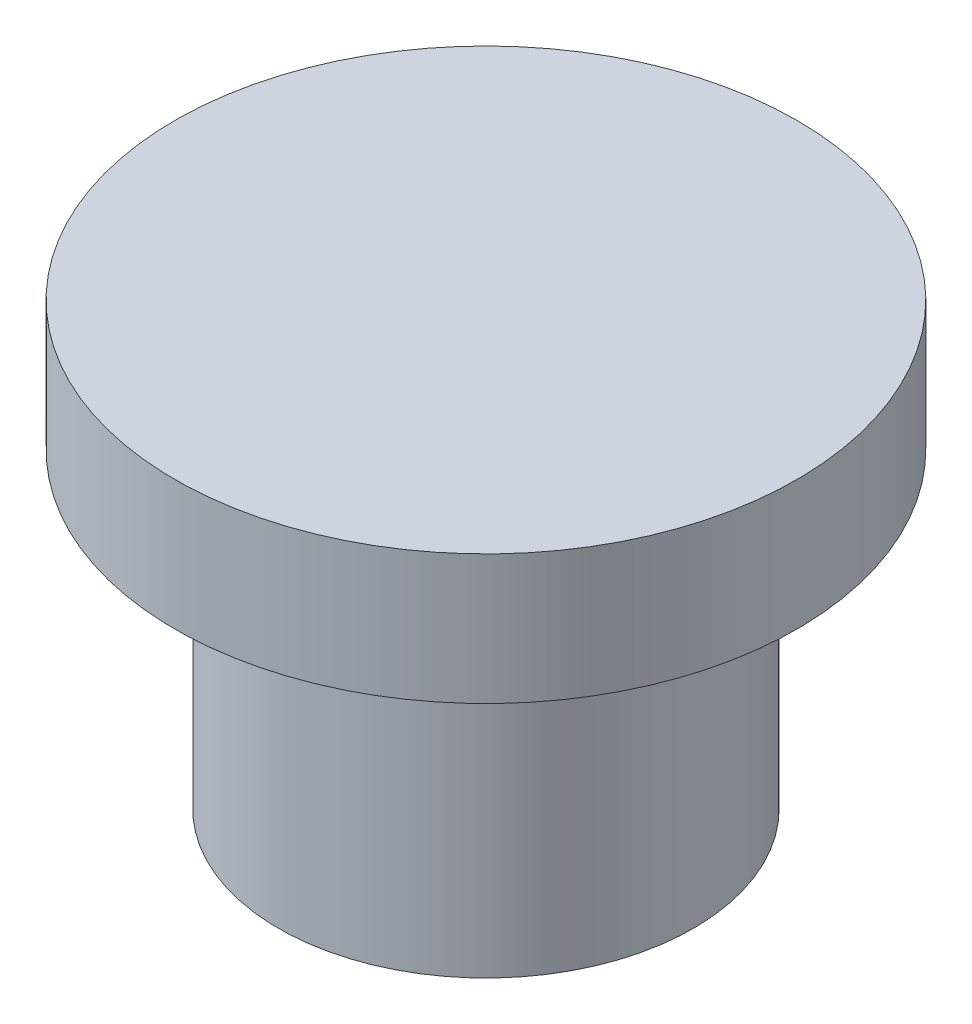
ISO-10303-21;
HEADER;
FILE_DESCRIPTION(('STEP AP214'),'2;1');
FILE_NAME('part.step','',(''),(''),'','','');
FILE_SCHEMA(('AUTOMOTIVE_DESIGN { 1 0 10303 214 1 1 1 1 }'));
ENDSEC;
DATA;
#1=APPLICATION_CONTEXT('core data for automotive mechanical design processes');
#2=APPLICATION_PROTOCOL_DEFINITION('international standard','automotive_design',2000,#1);
#3=PRODUCT_CONTEXT('',#1,'mechanical');
#4=PRODUCT('Part','Part','',(#3));
#5=PRODUCT_RELATED_PRODUCT_CATEGORY('part','',(#4));
#6=PRODUCT_DEFINITION_FORMATION('','',#4);
#7=PRODUCT_DEFINITION_CONTEXT('part definition',#1,'design');
#8=PRODUCT_DEFINITION('design','',#6,#7);
#9=PRODUCT_DEFINITION_SHAPE('','',#8);
#10=(LENGTH_UNIT() NAMED_UNIT(*) SI_UNIT(.MILLI.,.METRE.));
#11=(NAMED_UNIT(*) PLANE_ANGLE_UNIT() SI_UNIT($,.RADIAN.));
#12=(NAMED_UNIT(*) SI_UNIT($,.STERADIAN.) SOLID_ANGLE_UNIT());
#13=UNCERTAINTY_MEASURE_WITH_UNIT(LENGTH_MEASURE(1.E-05),#10,'distance_accuracy_value','');
#14=(GEOMETRIC_REPRESENTATION_CONTEXT(3) GLOBAL_UNCERTAINTY_ASSIGNED_CONTEXT((#13)) GLOBAL_UNIT_ASSIGNED_CONTEXT((#10,
#11,#12)) REPRESENTATION_CONTEXT('',''));
#15=CARTESIAN_POINT('',(0.,0.,0.));
#16=DIRECTION('',(0.,0.,1.));
#17=DIRECTION('',(1.,0.,0.));
#18=AXIS2_PLACEMENT_3D('',#15,#16,#17);
#19=CARTESIAN_POINT('',(0.,3.4,0.));
#20=DIRECTION('',(0.,1.,0.));
#21=DIRECTION('',(0.,0.,1.));
#22=AXIS2_PLACEMENT_3D('',#19,#20,#21);
#23=PLANE('',#22);
#24=CARTESIAN_POINT('',(0.,3.4,0.));
#25=DIRECTION('',(0.,-1.,0.));
#26=DIRECTION('',(0.,0.,-1.));
#27=AXIS2_PLACEMENT_3D('',#24,#25,#26);
#28=CIRCLE('',#27,2.4);
#29=CARTESIAN_POINT('',(0.,3.4,-2.4));
#30=VERTEX_POINT('',#29);
#31=EDGE_CURVE('E10',#30,#30,#28,.T.);
#32=ORIENTED_EDGE('',*,*,#31,.F.);
#33=EDGE_LOOP('',(#32));
#34=FACE_BOUND('',#33,.T.);
#35=ADVANCED_FACE('F34',(#34),#23,.T.);
#36=CARTESIAN_POINT('',(0.,0.,0.));
#37=DIRECTION('',(0.,-1.,0.));
#38=DIRECTION('',(0.,0.,-1.));
#39=AXIS2_PLACEMENT_3D('',#36,#37,#38);
#40=CYLINDRICAL_SURFACE('',#39,2.40000000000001);
#41=ORIENTED_EDGE('',*,*,#31,.T.);
#42=EDGE_LOOP('',(#41));
#43=FACE_BOUND('',#42,.T.);
#44=CARTESIAN_POINT('',(0.,2.4,0.));
#45=DIRECTION('',(0.,-1.,0.));
#46=DIRECTION('',(0.,0.,-1.));
#47=AXIS2_PLACEMENT_3D('',#44,#45,#46);
#48=CIRCLE('',#47,2.40000000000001);
#49=CARTESIAN_POINT('',(0.,2.4,-2.40000000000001));
#50=VERTEX_POINT('',#49);
#51=EDGE_CURVE('E40',#50,#50,#48,.T.);
#52=ORIENTED_EDGE('',*,*,#51,.F.);
#53=EDGE_LOOP('',(#52));
#54=FACE_BOUND('',#53,.T.);
#55=ADVANCED_FACE('F66',(#43,#54),#40,.T.);
#56=CARTESIAN_POINT('',(2.40000000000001,2.4,0.));
#57=DIRECTION('',(0.,-1.,0.));
#58=DIRECTION('',(0.,0.,-1.));
#59=AXIS2_PLACEMENT_3D('',#56,#57,#58);
#60=PLANE('',#59);
#61=ORIENTED_EDGE('',*,*,#51,.T.);
#62=EDGE_LOOP('',(#61));
#63=FACE_BOUND('',#62,.T.);
#64=CARTESIAN_POINT('',(0.,2.4,0.));
#65=DIRECTION('',(0.,-1.,0.));
#66=DIRECTION('',(0.,0.,-1.));
#67=AXIS2_PLACEMENT_3D('',#64,#65,#66);
#68=CIRCLE('',#67,1.6);
#69=CARTESIAN_POINT('',(0.,2.4,-1.6));
#70=VERTEX_POINT('',#69);
#71=EDGE_CURVE('E44',#70,#70,#68,.T.);
#72=ORIENTED_EDGE('',*,*,#71,.F.);
#73=EDGE_LOOP('',(#72));
#74=FACE_BOUND('',#73,.T.);
#75=ADVANCED_FACE('F58',(#63,#74),#60,.T.);
#76=CARTESIAN_POINT('',(0.,0.,0.));
#77=DIRECTION('',(0.,-1.,0.));
#78=DIRECTION('',(0.,0.,-1.));
#79=AXIS2_PLACEMENT_3D('',#76,#77,#78);
#80=CYLINDRICAL_SURFACE('',#79,1.6);
#81=ORIENTED_EDGE('',*,*,#71,.T.);
#82=EDGE_LOOP('',(#81));
#83=FACE_BOUND('',#82,.T.);
#84=CARTESIAN_POINT('',(0.,0.,0.));
#85=DIRECTION('',(0.,-1.,0.));
#86=DIRECTION('',(0.,0.,-1.));
#87=AXIS2_PLACEMENT_3D('',#84,#85,#86);
#88=CIRCLE('',#87,1.6);
#89=CARTESIAN_POINT('',(0.,0.,-1.6));
#90=VERTEX_POINT('',#89);
#91=EDGE_CURVE('E48',#90,#90,#88,.T.);
#92=ORIENTED_EDGE('',*,*,#91,.F.);
#93=EDGE_LOOP('',(#92));
#94=FACE_BOUND('',#93,.T.);
#95=ADVANCED_FACE('F56',(#83,#94),#80,.T.);
#96=CARTESIAN_POINT('',(1.6,0.,0.));
#97=DIRECTION('',(0.,-1.,0.));
#98=DIRECTION('',(0.,0.,-1.));
#99=AXIS2_PLACEMENT_3D('',#96,#97,#98);
#100=PLANE('',#99);
#101=ORIENTED_EDGE('',*,*,#91,.T.);
#102=EDGE_LOOP('',(#101));
#103=FACE_BOUND('',#102,.T.);
#104=ADVANCED_FACE('F54',(#103),#100,.T.);
#105=CLOSED_SHELL('',(#35,#55,#75,#95,#104));
#106=MANIFOLD_SOLID_BREP('B2',#105);
#107=ADVANCED_BREP_SHAPE_REPRESENTATION('',(#18,#106),#14);
#108=SHAPE_DEFINITION_REPRESENTATION(#9,#107);
ENDSEC;
END-ISO-10303-21;
